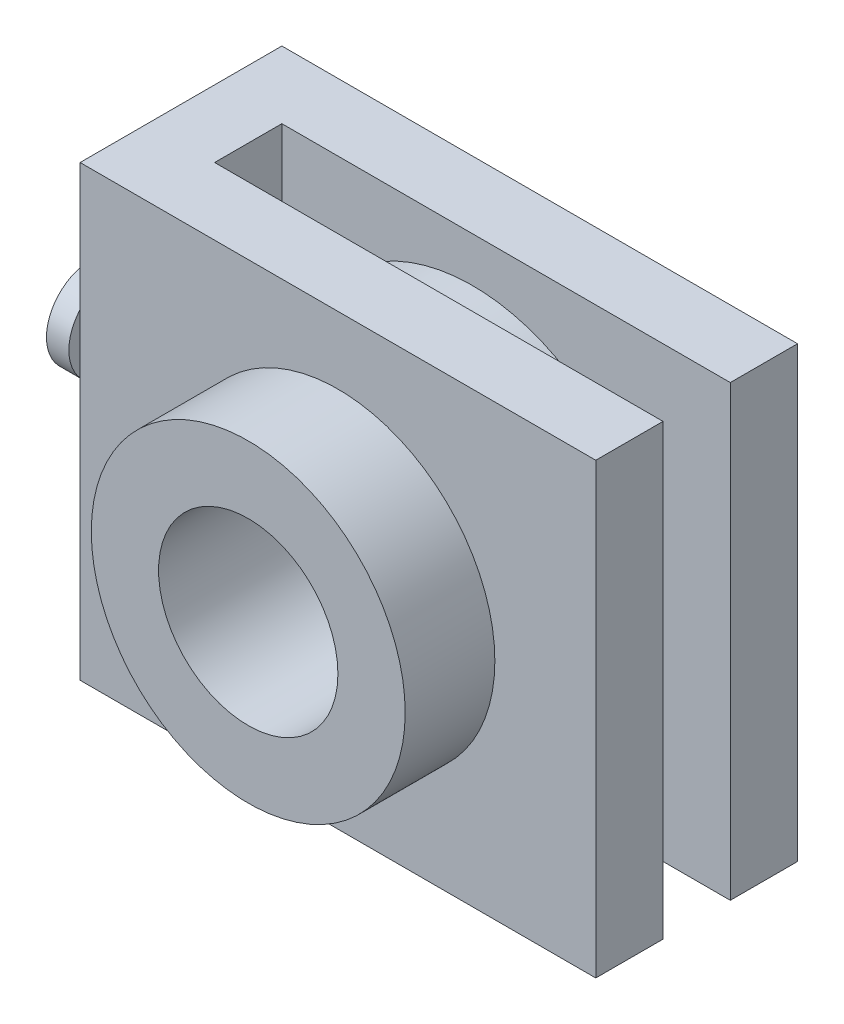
ISO-10303-21;
HEADER;
FILE_DESCRIPTION(('STEP AP214'),'2;1');
FILE_NAME('part.step','',(''),(''),'','','');
FILE_SCHEMA(('AUTOMOTIVE_DESIGN { 1 0 10303 214 1 1 1 1 }'));
ENDSEC;
DATA;
#1=APPLICATION_CONTEXT('core data for automotive mechanical design processes');
#2=APPLICATION_PROTOCOL_DEFINITION('international standard','automotive_design',2000,#1);
#3=PRODUCT_CONTEXT('',#1,'mechanical');
#4=PRODUCT('Part','Part','',(#3));
#5=PRODUCT_RELATED_PRODUCT_CATEGORY('part','',(#4));
#6=PRODUCT_DEFINITION_FORMATION('','',#4);
#7=PRODUCT_DEFINITION_CONTEXT('part definition',#1,'design');
#8=PRODUCT_DEFINITION('design','',#6,#7);
#9=PRODUCT_DEFINITION_SHAPE('','',#8);
#10=(LENGTH_UNIT() NAMED_UNIT(*) SI_UNIT(.MILLI.,.METRE.));
#11=(NAMED_UNIT(*) PLANE_ANGLE_UNIT() SI_UNIT($,.RADIAN.));
#12=(NAMED_UNIT(*) SI_UNIT($,.STERADIAN.) SOLID_ANGLE_UNIT());
#13=UNCERTAINTY_MEASURE_WITH_UNIT(LENGTH_MEASURE(1.E-05),#10,'distance_accuracy_value','');
#14=(GEOMETRIC_REPRESENTATION_CONTEXT(3) GLOBAL_UNCERTAINTY_ASSIGNED_CONTEXT((#13)) GLOBAL_UNIT_ASSIGNED_CONTEXT((#10,
#11,#12)) REPRESENTATION_CONTEXT('',''));
#15=CARTESIAN_POINT('',(0.,0.,0.));
#16=DIRECTION('',(0.,0.,1.));
#17=DIRECTION('',(1.,0.,0.));
#18=AXIS2_PLACEMENT_3D('',#15,#16,#17);
#19=CARTESIAN_POINT('',(10.,-10.,3.));
#20=DIRECTION('',(0.,1.,0.));
#21=DIRECTION('',(-1.,0.,0.));
#22=AXIS2_PLACEMENT_3D('',#19,#20,#21);
#23=PLANE('',#22);
#24=DIRECTION('',(1.,0.,0.));
#25=VECTOR('',#24,1.);
#26=CARTESIAN_POINT('',(10.,-10.,0.));
#27=LINE('',#26,#25);
#28=CARTESIAN_POINT('',(-10.,-10.,0.));
#29=VERTEX_POINT('',#28);
#30=CARTESIAN_POINT('',(10.,-10.,0.));
#31=VERTEX_POINT('',#30);
#32=EDGE_CURVE('E106',#29,#31,#27,.T.);
#33=ORIENTED_EDGE('',*,*,#32,.T.);
#34=DIRECTION('',(0.,0.,-1.));
#35=VECTOR('',#34,1.);
#36=CARTESIAN_POINT('',(10.,-10.,3.));
#37=LINE('',#36,#35);
#38=CARTESIAN_POINT('',(10.,-10.,3.));
#39=VERTEX_POINT('',#38);
#40=EDGE_CURVE('E62',#39,#31,#37,.T.);
#41=ORIENTED_EDGE('',*,*,#40,.F.);
#42=DIRECTION('',(1.,0.,0.));
#43=VECTOR('',#42,1.);
#44=CARTESIAN_POINT('',(10.,-10.,3.));
#45=LINE('',#44,#43);
#46=CARTESIAN_POINT('',(-13.,-10.,3.));
#47=VERTEX_POINT('',#46);
#48=EDGE_CURVE('E100',#47,#39,#45,.T.);
#49=ORIENTED_EDGE('',*,*,#48,.F.);
#50=DIRECTION('',(0.,0.,1.));
#51=VECTOR('',#50,1.);
#52=CARTESIAN_POINT('',(-13.,-10.,-6.));
#53=LINE('',#52,#51);
#54=CARTESIAN_POINT('',(-13.,-10.,-6.));
#55=VERTEX_POINT('',#54);
#56=EDGE_CURVE('E124',#55,#47,#53,.T.);
#57=ORIENTED_EDGE('',*,*,#56,.F.);
#58=DIRECTION('',(1.,0.,0.));
#59=VECTOR('',#58,1.);
#60=CARTESIAN_POINT('',(-13.,-10.,-6.));
#61=LINE('',#60,#59);
#62=CARTESIAN_POINT('',(10.,-10.,-6.));
#63=VERTEX_POINT('',#62);
#64=EDGE_CURVE('E110',#55,#63,#61,.T.);
#65=ORIENTED_EDGE('',*,*,#64,.T.);
#66=DIRECTION('',(0.,0.,-1.));
#67=VECTOR('',#66,1.);
#68=CARTESIAN_POINT('',(10.,-10.,-6.));
#69=LINE('',#68,#67);
#70=CARTESIAN_POINT('',(10.,-10.,-3.));
#71=VERTEX_POINT('',#70);
#72=EDGE_CURVE('E203',#71,#63,#69,.T.);
#73=ORIENTED_EDGE('',*,*,#72,.F.);
#74=DIRECTION('',(1.,0.,0.));
#75=VECTOR('',#74,1.);
#76=CARTESIAN_POINT('',(-10.,-10.,-3.));
#77=LINE('',#76,#75);
#78=CARTESIAN_POINT('',(-10.,-10.,-3.));
#79=VERTEX_POINT('',#78);
#80=EDGE_CURVE('E164',#79,#71,#77,.T.);
#81=ORIENTED_EDGE('',*,*,#80,.F.);
#82=DIRECTION('',(0.,0.,1.));
#83=VECTOR('',#82,1.);
#84=CARTESIAN_POINT('',(-10.,-10.,-6.));
#85=LINE('',#84,#83);
#86=EDGE_CURVE('E118',#79,#29,#85,.T.);
#87=ORIENTED_EDGE('',*,*,#86,.T.);
#88=EDGE_LOOP('',(#33,#41,#49,#57,#65,#73,#81,#87));
#89=FACE_BOUND('',#88,.T.);
#90=ADVANCED_FACE('F53',(#89),#23,.F.);
#91=CARTESIAN_POINT('',(10.,-10.,3.));
#92=DIRECTION('',(-1.,0.,0.));
#93=DIRECTION('',(0.,0.,1.));
#94=AXIS2_PLACEMENT_3D('',#91,#92,#93);
#95=PLANE('',#94);
#96=DIRECTION('',(0.,1.,0.));
#97=VECTOR('',#96,1.);
#98=CARTESIAN_POINT('',(10.,-10.,0.));
#99=LINE('',#98,#97);
#100=CARTESIAN_POINT('',(10.,10.,0.));
#101=VERTEX_POINT('',#100);
#102=EDGE_CURVE('E83',#31,#101,#99,.T.);
#103=ORIENTED_EDGE('',*,*,#102,.T.);
#104=DIRECTION('',(0.,0.,-1.));
#105=VECTOR('',#104,1.);
#106=CARTESIAN_POINT('',(10.,10.,3.));
#107=LINE('',#106,#105);
#108=CARTESIAN_POINT('',(10.,10.,3.));
#109=VERTEX_POINT('',#108);
#110=EDGE_CURVE('E97',#109,#101,#107,.T.);
#111=ORIENTED_EDGE('',*,*,#110,.F.);
#112=DIRECTION('',(0.,1.,0.));
#113=VECTOR('',#112,1.);
#114=CARTESIAN_POINT('',(10.,-10.,3.));
#115=LINE('',#114,#113);
#116=EDGE_CURVE('E70',#39,#109,#115,.T.);
#117=ORIENTED_EDGE('',*,*,#116,.F.);
#118=ORIENTED_EDGE('',*,*,#40,.T.);
#119=EDGE_LOOP('',(#103,#111,#117,#118));
#120=FACE_BOUND('',#119,.T.);
#121=ADVANCED_FACE('F154',(#120),#95,.F.);
#122=CARTESIAN_POINT('',(10.,10.,3.));
#123=DIRECTION('',(0.,-1.,0.));
#124=DIRECTION('',(1.,0.,0.));
#125=AXIS2_PLACEMENT_3D('',#122,#123,#124);
#126=PLANE('',#125);
#127=DIRECTION('',(-1.,0.,0.));
#128=VECTOR('',#127,1.);
#129=CARTESIAN_POINT('',(10.,10.,0.));
#130=LINE('',#129,#128);
#131=CARTESIAN_POINT('',(-10.,10.,0.));
#132=VERTEX_POINT('',#131);
#133=EDGE_CURVE('E89',#101,#132,#130,.T.);
#134=ORIENTED_EDGE('',*,*,#133,.T.);
#135=DIRECTION('',(0.,0.,-1.));
#136=VECTOR('',#135,1.);
#137=CARTESIAN_POINT('',(-10.,10.,-6.));
#138=LINE('',#137,#136);
#139=CARTESIAN_POINT('',(-10.,10.,-3.));
#140=VERTEX_POINT('',#139);
#141=EDGE_CURVE('E95',#132,#140,#138,.T.);
#142=ORIENTED_EDGE('',*,*,#141,.T.);
#143=DIRECTION('',(1.,0.,0.));
#144=VECTOR('',#143,1.);
#145=CARTESIAN_POINT('',(-10.,10.,-3.));
#146=LINE('',#145,#144);
#147=CARTESIAN_POINT('',(10.,10.,-3.));
#148=VERTEX_POINT('',#147);
#149=EDGE_CURVE('E127',#140,#148,#146,.T.);
#150=ORIENTED_EDGE('',*,*,#149,.T.);
#151=DIRECTION('',(0.,0.,1.));
#152=VECTOR('',#151,1.);
#153=CARTESIAN_POINT('',(10.,10.,-6.));
#154=LINE('',#153,#152);
#155=CARTESIAN_POINT('',(10.,10.,-6.));
#156=VERTEX_POINT('',#155);
#157=EDGE_CURVE('E196',#156,#148,#154,.T.);
#158=ORIENTED_EDGE('',*,*,#157,.F.);
#159=DIRECTION('',(1.,0.,0.));
#160=VECTOR('',#159,1.);
#161=CARTESIAN_POINT('',(-13.,10.,-6.));
#162=LINE('',#161,#160);
#163=CARTESIAN_POINT('',(-13.,10.,-6.));
#164=VERTEX_POINT('',#163);
#165=EDGE_CURVE('E131',#164,#156,#162,.T.);
#166=ORIENTED_EDGE('',*,*,#165,.F.);
#167=DIRECTION('',(0.,0.,-1.));
#168=VECTOR('',#167,1.);
#169=CARTESIAN_POINT('',(-13.,10.,-6.));
#170=LINE('',#169,#168);
#171=CARTESIAN_POINT('',(-13.,10.,3.));
#172=VERTEX_POINT('',#171);
#173=EDGE_CURVE('E135',#172,#164,#170,.T.);
#174=ORIENTED_EDGE('',*,*,#173,.F.);
#175=DIRECTION('',(-1.,0.,0.));
#176=VECTOR('',#175,1.);
#177=CARTESIAN_POINT('',(10.,10.,3.));
#178=LINE('',#177,#176);
#179=EDGE_CURVE('E143',#109,#172,#178,.T.);
#180=ORIENTED_EDGE('',*,*,#179,.F.);
#181=ORIENTED_EDGE('',*,*,#110,.T.);
#182=EDGE_LOOP('',(#134,#142,#150,#158,#166,#174,#180,#181));
#183=FACE_BOUND('',#182,.T.);
#184=ADVANCED_FACE('F91',(#183),#126,.F.);
#185=CARTESIAN_POINT('',(0.,0.,3.));
#186=DIRECTION('',(0.,0.,1.));
#187=DIRECTION('',(1.,0.,0.));
#188=AXIS2_PLACEMENT_3D('',#185,#186,#187);
#189=PLANE('',#188);
#190=CARTESIAN_POINT('',(-1.5,0.,3.));
#191=DIRECTION('',(0.,0.,1.));
#192=DIRECTION('',(1.,0.,0.));
#193=AXIS2_PLACEMENT_3D('',#190,#191,#192);
#194=CIRCLE('',#193,7.);
#195=CARTESIAN_POINT('',(5.5,0.,3.));
#196=VERTEX_POINT('',#195);
#197=EDGE_CURVE('E246',#196,#196,#194,.T.);
#198=ORIENTED_EDGE('',*,*,#197,.F.);
#199=EDGE_LOOP('',(#198));
#200=FACE_BOUND('',#199,.T.);
#201=ORIENTED_EDGE('',*,*,#179,.T.);
#202=DIRECTION('',(0.,1.,0.));
#203=VECTOR('',#202,1.);
#204=CARTESIAN_POINT('',(-13.,10.,3.));
#205=LINE('',#204,#203);
#206=EDGE_CURVE('E192',#47,#172,#205,.T.);
#207=ORIENTED_EDGE('',*,*,#206,.F.);
#208=ORIENTED_EDGE('',*,*,#48,.T.);
#209=ORIENTED_EDGE('',*,*,#116,.T.);
#210=EDGE_LOOP('',(#201,#207,#208,#209));
#211=FACE_BOUND('',#210,.T.);
#212=ADVANCED_FACE('F293',(#200,#211),#189,.T.);
#213=CARTESIAN_POINT('',(0.,0.,0.));
#214=DIRECTION('',(0.,0.,1.));
#215=DIRECTION('',(1.,0.,0.));
#216=AXIS2_PLACEMENT_3D('',#213,#214,#215);
#217=PLANE('',#216);
#218=CARTESIAN_POINT('',(-1.5,0.,0.));
#219=DIRECTION('',(0.,0.,1.));
#220=DIRECTION('',(1.,0.,0.));
#221=AXIS2_PLACEMENT_3D('',#218,#219,#220);
#222=CIRCLE('',#221,8.);
#223=CARTESIAN_POINT('',(6.5,0.,0.));
#224=VERTEX_POINT('',#223);
#225=EDGE_CURVE('E11',#224,#224,#222,.F.);
#226=ORIENTED_EDGE('',*,*,#225,.F.);
#227=EDGE_LOOP('',(#226));
#228=FACE_BOUND('',#227,.T.);
#229=DIRECTION('',(0.,-1.,0.));
#230=VECTOR('',#229,1.);
#231=CARTESIAN_POINT('',(-10.,-10.,0.));
#232=LINE('',#231,#230);
#233=EDGE_CURVE('E104',#132,#29,#232,.T.);
#234=ORIENTED_EDGE('',*,*,#233,.F.);
#235=ORIENTED_EDGE('',*,*,#133,.F.);
#236=ORIENTED_EDGE('',*,*,#102,.F.);
#237=ORIENTED_EDGE('',*,*,#32,.F.);
#238=EDGE_LOOP('',(#234,#235,#236,#237));
#239=FACE_BOUND('',#238,.T.);
#240=ADVANCED_FACE('F105',(#228,#239),#217,.F.);
#241=CARTESIAN_POINT('',(-10.,0.,0.));
#242=DIRECTION('',(-1.,0.,0.));
#243=DIRECTION('',(0.,0.,1.));
#244=AXIS2_PLACEMENT_3D('',#241,#242,#243);
#245=PLANE('',#244);
#246=ORIENTED_EDGE('',*,*,#86,.F.);
#247=DIRECTION('',(0.,-1.,0.));
#248=VECTOR('',#247,1.);
#249=CARTESIAN_POINT('',(-10.,10.,-3.));
#250=LINE('',#249,#248);
#251=EDGE_CURVE('E115',#140,#79,#250,.T.);
#252=ORIENTED_EDGE('',*,*,#251,.F.);
#253=ORIENTED_EDGE('',*,*,#141,.F.);
#254=ORIENTED_EDGE('',*,*,#233,.T.);
#255=EDGE_LOOP('',(#246,#252,#253,#254));
#256=FACE_BOUND('',#255,.T.);
#257=ADVANCED_FACE('F113',(#256),#245,.F.);
#258=CARTESIAN_POINT('',(-13.,10.,-6.));
#259=DIRECTION('',(0.,0.,1.));
#260=DIRECTION('',(1.,0.,0.));
#261=AXIS2_PLACEMENT_3D('',#258,#259,#260);
#262=PLANE('',#261);
#263=CARTESIAN_POINT('',(-1.5,0.,-6.));
#264=DIRECTION('',(0.,0.,1.));
#265=DIRECTION('',(1.,0.,0.));
#266=AXIS2_PLACEMENT_3D('',#263,#264,#265);
#267=CIRCLE('',#266,7.);
#268=CARTESIAN_POINT('',(5.5,0.,-6.));
#269=VERTEX_POINT('',#268);
#270=EDGE_CURVE('E239',#269,#269,#267,.T.);
#271=ORIENTED_EDGE('',*,*,#270,.T.);
#272=EDGE_LOOP('',(#271));
#273=FACE_BOUND('',#272,.T.);
#274=ORIENTED_EDGE('',*,*,#165,.T.);
#275=DIRECTION('',(0.,1.,0.));
#276=VECTOR('',#275,1.);
#277=CARTESIAN_POINT('',(10.,10.,-6.));
#278=LINE('',#277,#276);
#279=EDGE_CURVE('E201',#63,#156,#278,.T.);
#280=ORIENTED_EDGE('',*,*,#279,.F.);
#281=ORIENTED_EDGE('',*,*,#64,.F.);
#282=DIRECTION('',(0.,-1.,0.));
#283=VECTOR('',#282,1.);
#284=CARTESIAN_POINT('',(-13.,10.,-6.));
#285=LINE('',#284,#283);
#286=EDGE_CURVE('E117',#164,#55,#285,.T.);
#287=ORIENTED_EDGE('',*,*,#286,.F.);
#288=EDGE_LOOP('',(#274,#280,#281,#287));
#289=FACE_BOUND('',#288,.T.);
#290=ADVANCED_FACE('F200',(#273,#289),#262,.F.);
#291=CARTESIAN_POINT('',(-13.,0.,0.));
#292=DIRECTION('',(-1.,0.,0.));
#293=DIRECTION('',(0.,0.,1.));
#294=AXIS2_PLACEMENT_3D('',#291,#292,#293);
#295=PLANE('',#294);
#296=CARTESIAN_POINT('',(-13.,0.,-1.5));
#297=DIRECTION('',(-1.,0.,0.));
#298=DIRECTION('',(0.,0.,1.));
#299=AXIS2_PLACEMENT_3D('',#296,#297,#298);
#300=CIRCLE('',#299,1.5);
#301=CARTESIAN_POINT('',(-13.,0.,0.));
#302=VERTEX_POINT('',#301);
#303=EDGE_CURVE('E227',#302,#302,#300,.T.);
#304=ORIENTED_EDGE('',*,*,#303,.F.);
#305=EDGE_LOOP('',(#304));
#306=FACE_BOUND('',#305,.T.);
#307=ORIENTED_EDGE('',*,*,#286,.T.);
#308=ORIENTED_EDGE('',*,*,#56,.T.);
#309=ORIENTED_EDGE('',*,*,#206,.T.);
#310=ORIENTED_EDGE('',*,*,#173,.T.);
#311=EDGE_LOOP('',(#307,#308,#309,#310));
#312=FACE_BOUND('',#311,.T.);
#313=ADVANCED_FACE('F188',(#306,#312),#295,.T.);
#314=CARTESIAN_POINT('',(-10.,10.,-3.));
#315=DIRECTION('',(0.,0.,1.));
#316=DIRECTION('',(0.,-1.,0.));
#317=AXIS2_PLACEMENT_3D('',#314,#315,#316);
#318=PLANE('',#317);
#319=CARTESIAN_POINT('',(-1.5,0.,-3.));
#320=DIRECTION('',(0.,0.,1.));
#321=DIRECTION('',(1.,0.,0.));
#322=AXIS2_PLACEMENT_3D('',#319,#320,#321);
#323=CIRCLE('',#322,8.);
#324=CARTESIAN_POINT('',(6.5,0.,-3.));
#325=VERTEX_POINT('',#324);
#326=EDGE_CURVE('E254',#325,#325,#323,.T.);
#327=ORIENTED_EDGE('',*,*,#326,.F.);
#328=EDGE_LOOP('',(#327));
#329=FACE_BOUND('',#328,.T.);
#330=DIRECTION('',(0.,-1.,0.));
#331=VECTOR('',#330,1.);
#332=CARTESIAN_POINT('',(10.,10.,-3.));
#333=LINE('',#332,#331);
#334=EDGE_CURVE('E221',#148,#71,#333,.T.);
#335=ORIENTED_EDGE('',*,*,#334,.F.);
#336=ORIENTED_EDGE('',*,*,#149,.F.);
#337=ORIENTED_EDGE('',*,*,#251,.T.);
#338=ORIENTED_EDGE('',*,*,#80,.T.);
#339=EDGE_LOOP('',(#335,#336,#337,#338));
#340=FACE_BOUND('',#339,.T.);
#341=ADVANCED_FACE('F309',(#329,#340),#318,.T.);
#342=CARTESIAN_POINT('',(10.,0.,0.));
#343=DIRECTION('',(-1.,0.,0.));
#344=DIRECTION('',(0.,0.,1.));
#345=AXIS2_PLACEMENT_3D('',#342,#343,#344);
#346=PLANE('',#345);
#347=ORIENTED_EDGE('',*,*,#334,.T.);
#348=ORIENTED_EDGE('',*,*,#72,.T.);
#349=ORIENTED_EDGE('',*,*,#279,.T.);
#350=ORIENTED_EDGE('',*,*,#157,.T.);
#351=EDGE_LOOP('',(#347,#348,#349,#350));
#352=FACE_BOUND('',#351,.T.);
#353=ADVANCED_FACE('F313',(#352),#346,.F.);
#354=CARTESIAN_POINT('',(-16.,0.,-1.5));
#355=DIRECTION('',(1.,0.,0.));
#356=DIRECTION('',(0.,0.,-1.));
#357=AXIS2_PLACEMENT_3D('',#354,#355,#356);
#358=CYLINDRICAL_SURFACE('',#357,1.5);
#359=CARTESIAN_POINT('',(-16.,0.,-1.5));
#360=DIRECTION('',(-1.,0.,0.));
#361=DIRECTION('',(0.,0.,1.));
#362=AXIS2_PLACEMENT_3D('',#359,#360,#361);
#363=CIRCLE('',#362,1.5);
#364=CARTESIAN_POINT('',(-16.,0.,0.));
#365=VERTEX_POINT('',#364);
#366=EDGE_CURVE('E224',#365,#365,#363,.T.);
#367=ORIENTED_EDGE('',*,*,#366,.F.);
#368=EDGE_LOOP('',(#367));
#369=FACE_BOUND('',#368,.T.);
#370=ORIENTED_EDGE('',*,*,#303,.T.);
#371=EDGE_LOOP('',(#370));
#372=FACE_BOUND('',#371,.T.);
#373=ADVANCED_FACE('F317',(#369,#372),#358,.T.);
#374=CARTESIAN_POINT('',(-17.,0.,-1.5));
#375=DIRECTION('',(1.,0.,0.));
#376=DIRECTION('',(0.,0.,-1.));
#377=AXIS2_PLACEMENT_3D('',#374,#375,#376);
#378=CYLINDRICAL_SURFACE('',#377,2.);
#379=CARTESIAN_POINT('',(-17.,0.,-1.5));
#380=DIRECTION('',(-1.,0.,0.));
#381=DIRECTION('',(0.,0.,1.));
#382=AXIS2_PLACEMENT_3D('',#379,#380,#381);
#383=CIRCLE('',#382,2.);
#384=CARTESIAN_POINT('',(-17.,0.,0.5));
#385=VERTEX_POINT('',#384);
#386=EDGE_CURVE('E231',#385,#385,#383,.T.);
#387=ORIENTED_EDGE('',*,*,#386,.F.);
#388=EDGE_LOOP('',(#387));
#389=FACE_BOUND('',#388,.T.);
#390=CARTESIAN_POINT('',(-16.,0.,-1.5));
#391=DIRECTION('',(-1.,0.,0.));
#392=DIRECTION('',(0.,0.,1.));
#393=AXIS2_PLACEMENT_3D('',#390,#391,#392);
#394=CIRCLE('',#393,2.);
#395=CARTESIAN_POINT('',(-16.,0.,0.5));
#396=VERTEX_POINT('',#395);
#397=EDGE_CURVE('E235',#396,#396,#394,.T.);
#398=ORIENTED_EDGE('',*,*,#397,.T.);
#399=EDGE_LOOP('',(#398));
#400=FACE_BOUND('',#399,.T.);
#401=ADVANCED_FACE('F321',(#389,#400),#378,.T.);
#402=CARTESIAN_POINT('',(-17.,0.,-1.5));
#403=DIRECTION('',(-1.,0.,0.));
#404=DIRECTION('',(0.,0.,1.));
#405=AXIS2_PLACEMENT_3D('',#402,#403,#404);
#406=PLANE('',#405);
#407=ORIENTED_EDGE('',*,*,#386,.T.);
#408=EDGE_LOOP('',(#407));
#409=FACE_BOUND('',#408,.T.);
#410=ADVANCED_FACE('F325',(#409),#406,.T.);
#411=CARTESIAN_POINT('',(-16.,0.,-1.5));
#412=DIRECTION('',(-1.,0.,0.));
#413=DIRECTION('',(0.,0.,1.));
#414=AXIS2_PLACEMENT_3D('',#411,#412,#413);
#415=PLANE('',#414);
#416=ORIENTED_EDGE('',*,*,#366,.T.);
#417=EDGE_LOOP('',(#416));
#418=FACE_BOUND('',#417,.T.);
#419=ORIENTED_EDGE('',*,*,#397,.F.);
#420=EDGE_LOOP('',(#419));
#421=FACE_BOUND('',#420,.T.);
#422=ADVANCED_FACE('F327',(#418,#421),#415,.F.);
#423=CARTESIAN_POINT('',(-1.5,0.,-7.));
#424=DIRECTION('',(0.,0.,1.));
#425=DIRECTION('',(1.,0.,0.));
#426=AXIS2_PLACEMENT_3D('',#423,#424,#425);
#427=CYLINDRICAL_SURFACE('',#426,7.);
#428=CARTESIAN_POINT('',(-1.5,0.,-3.));
#429=DIRECTION('',(0.,0.,1.));
#430=DIRECTION('',(1.,0.,0.));
#431=AXIS2_PLACEMENT_3D('',#428,#429,#430);
#432=CIRCLE('',#431,7.);
#433=CARTESIAN_POINT('',(5.5,0.,-3.));
#434=VERTEX_POINT('',#433);
#435=EDGE_CURVE('E250',#434,#434,#432,.F.);
#436=ORIENTED_EDGE('',*,*,#435,.F.);
#437=EDGE_LOOP('',(#436));
#438=FACE_BOUND('',#437,.T.);
#439=ORIENTED_EDGE('',*,*,#270,.F.);
#440=EDGE_LOOP('',(#439));
#441=FACE_BOUND('',#440,.T.);
#442=ADVANCED_FACE('F330',(#438,#441),#427,.F.);
#443=CARTESIAN_POINT('',(-1.5,0.,22.6274169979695));
#444=DIRECTION('',(0.,0.,-1.));
#445=DIRECTION('',(-1.,0.,0.));
#446=AXIS2_PLACEMENT_3D('',#443,#444,#445);
#447=CYLINDRICAL_SURFACE('',#446,4.);
#448=CARTESIAN_POINT('',(-1.5,0.,-3.));
#449=DIRECTION('',(0.,0.,1.));
#450=DIRECTION('',(1.,0.,0.));
#451=AXIS2_PLACEMENT_3D('',#448,#449,#450);
#452=CIRCLE('',#451,4.);
#453=CARTESIAN_POINT('',(2.5,0.,-3.));
#454=VERTEX_POINT('',#453);
#455=EDGE_CURVE('E258',#454,#454,#452,.T.);
#456=ORIENTED_EDGE('',*,*,#455,.F.);
#457=EDGE_LOOP('',(#456));
#458=FACE_BOUND('',#457,.T.);
#459=CARTESIAN_POINT('',(-1.5,0.,7.));
#460=DIRECTION('',(0.,0.,1.));
#461=DIRECTION('',(1.,0.,0.));
#462=AXIS2_PLACEMENT_3D('',#459,#460,#461);
#463=CIRCLE('',#462,4.);
#464=CARTESIAN_POINT('',(2.5,0.,7.));
#465=VERTEX_POINT('',#464);
#466=EDGE_CURVE('E266',#465,#465,#463,.T.);
#467=ORIENTED_EDGE('',*,*,#466,.T.);
#468=EDGE_LOOP('',(#467));
#469=FACE_BOUND('',#468,.T.);
#470=ADVANCED_FACE('F271',(#458,#469),#447,.F.);
#471=CARTESIAN_POINT('',(-1.5,0.,-3.));
#472=DIRECTION('',(0.,0.,1.));
#473=DIRECTION('',(1.,0.,0.));
#474=AXIS2_PLACEMENT_3D('',#471,#472,#473);
#475=PLANE('',#474);
#476=ORIENTED_EDGE('',*,*,#455,.T.);
#477=EDGE_LOOP('',(#476));
#478=FACE_BOUND('',#477,.T.);
#479=ORIENTED_EDGE('',*,*,#435,.T.);
#480=EDGE_LOOP('',(#479));
#481=FACE_BOUND('',#480,.T.);
#482=ADVANCED_FACE('F285',(#478,#481),#475,.F.);
#483=CARTESIAN_POINT('',(-1.5,0.,22.6274169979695));
#484=DIRECTION('',(0.,0.,-1.));
#485=DIRECTION('',(-1.,0.,0.));
#486=AXIS2_PLACEMENT_3D('',#483,#484,#485);
#487=CYLINDRICAL_SURFACE('',#486,8.);
#488=ORIENTED_EDGE('',*,*,#326,.T.);
#489=EDGE_LOOP('',(#488));
#490=FACE_BOUND('',#489,.T.);
#491=ORIENTED_EDGE('',*,*,#225,.T.);
#492=EDGE_LOOP('',(#491));
#493=FACE_BOUND('',#492,.T.);
#494=ADVANCED_FACE('F276',(#490,#493),#487,.T.);
#495=CARTESIAN_POINT('',(-1.5,0.,7.));
#496=DIRECTION('',(0.,0.,1.));
#497=DIRECTION('',(1.,0.,0.));
#498=AXIS2_PLACEMENT_3D('',#495,#496,#497);
#499=PLANE('',#498);
#500=CARTESIAN_POINT('',(-1.5,0.,7.));
#501=DIRECTION('',(0.,0.,1.));
#502=DIRECTION('',(1.,0.,0.));
#503=AXIS2_PLACEMENT_3D('',#500,#501,#502);
#504=CIRCLE('',#503,7.);
#505=CARTESIAN_POINT('',(5.5,0.,7.));
#506=VERTEX_POINT('',#505);
#507=EDGE_CURVE('E262',#506,#506,#504,.T.);
#508=ORIENTED_EDGE('',*,*,#507,.T.);
#509=EDGE_LOOP('',(#508));
#510=FACE_BOUND('',#509,.T.);
#511=ORIENTED_EDGE('',*,*,#466,.F.);
#512=EDGE_LOOP('',(#511));
#513=FACE_BOUND('',#512,.T.);
#514=ADVANCED_FACE('F273',(#510,#513),#499,.T.);
#515=CARTESIAN_POINT('',(-1.5,0.,7.));
#516=DIRECTION('',(0.,0.,-1.));
#517=DIRECTION('',(-1.,0.,0.));
#518=AXIS2_PLACEMENT_3D('',#515,#516,#517);
#519=CYLINDRICAL_SURFACE('',#518,7.);
#520=ORIENTED_EDGE('',*,*,#197,.T.);
#521=EDGE_LOOP('',(#520));
#522=FACE_BOUND('',#521,.T.);
#523=ORIENTED_EDGE('',*,*,#507,.F.);
#524=EDGE_LOOP('',(#523));
#525=FACE_BOUND('',#524,.T.);
#526=ADVANCED_FACE('F275',(#522,#525),#519,.T.);
#527=CLOSED_SHELL('',(#90,#121,#184,#212,#240,#257,#290,#313,#341,#353,#373,#401,#410,#422,#442,
#470,#482,#494,#514,#526));
#528=MANIFOLD_SOLID_BREP('B2',#527);
#529=ADVANCED_BREP_SHAPE_REPRESENTATION('',(#18,#528),#14);
#530=SHAPE_DEFINITION_REPRESENTATION(#9,#529);
ENDSEC;
END-ISO-10303-21;
